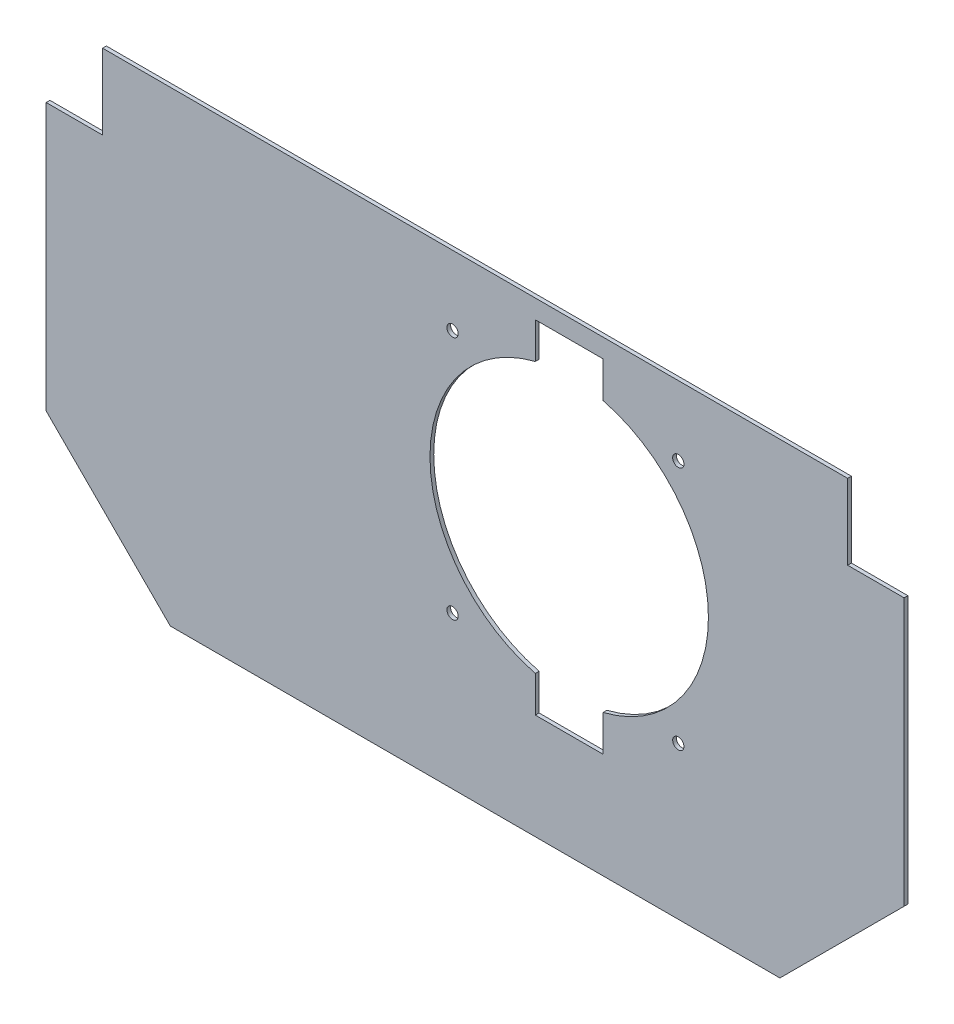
ISO-10303-21;
HEADER;
FILE_DESCRIPTION(('STEP AP214'),'2;1');
FILE_NAME('part.step','',(''),(''),'','','');
FILE_SCHEMA(('AUTOMOTIVE_DESIGN { 1 0 10303 214 1 1 1 1 }'));
ENDSEC;
DATA;
#1=APPLICATION_CONTEXT('core data for automotive mechanical design processes');
#2=APPLICATION_PROTOCOL_DEFINITION('international standard','automotive_design',2000,#1);
#3=PRODUCT_CONTEXT('',#1,'mechanical');
#4=PRODUCT('Part','Part','',(#3));
#5=PRODUCT_RELATED_PRODUCT_CATEGORY('part','',(#4));
#6=PRODUCT_DEFINITION_FORMATION('','',#4);
#7=PRODUCT_DEFINITION_CONTEXT('part definition',#1,'design');
#8=PRODUCT_DEFINITION('design','',#6,#7);
#9=PRODUCT_DEFINITION_SHAPE('','',#8);
#10=(LENGTH_UNIT() NAMED_UNIT(*) SI_UNIT(.MILLI.,.METRE.));
#11=(NAMED_UNIT(*) PLANE_ANGLE_UNIT() SI_UNIT($,.RADIAN.));
#12=(NAMED_UNIT(*) SI_UNIT($,.STERADIAN.) SOLID_ANGLE_UNIT());
#13=UNCERTAINTY_MEASURE_WITH_UNIT(LENGTH_MEASURE(1.E-05),#10,'distance_accuracy_value','');
#14=(GEOMETRIC_REPRESENTATION_CONTEXT(3) GLOBAL_UNCERTAINTY_ASSIGNED_CONTEXT((#13)) GLOBAL_UNIT_ASSIGNED_CONTEXT((#10,
#11,#12)) REPRESENTATION_CONTEXT('',''));
#15=CARTESIAN_POINT('',(0.,0.,0.));
#16=DIRECTION('',(0.,0.,1.));
#17=DIRECTION('',(1.,0.,0.));
#18=AXIS2_PLACEMENT_3D('',#15,#16,#17);
#19=CARTESIAN_POINT('',(0.,0.,1.));
#20=DIRECTION('',(0.,0.,-1.));
#21=DIRECTION('',(-1.,0.,0.));
#22=AXIS2_PLACEMENT_3D('',#19,#20,#21);
#23=PLANE('',#22);
#24=DIRECTION('',(-1.,0.,0.));
#25=VECTOR('',#24,1.);
#26=CARTESIAN_POINT('',(-73.8346823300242,58.4591752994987,1.));
#27=LINE('',#26,#25);
#28=CARTESIAN_POINT('',(124.165317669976,58.4591752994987,1.));
#29=VERTEX_POINT('',#28);
#30=CARTESIAN_POINT('',(-73.8346823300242,58.4591752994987,1.));
#31=VERTEX_POINT('',#30);
#32=EDGE_CURVE('E228',#29,#31,#27,.T.);
#33=ORIENTED_EDGE('',*,*,#32,.T.);
#34=DIRECTION('',(0.,-1.,0.));
#35=VECTOR('',#34,1.);
#36=CARTESIAN_POINT('',(-73.8346823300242,58.4591752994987,1.));
#37=LINE('',#36,#35);
#38=CARTESIAN_POINT('',(-73.8346823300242,38.4591752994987,1.));
#39=VERTEX_POINT('',#38);
#40=EDGE_CURVE('E231',#31,#39,#37,.T.);
#41=ORIENTED_EDGE('',*,*,#40,.T.);
#42=DIRECTION('',(-1.,0.,0.));
#43=VECTOR('',#42,1.);
#44=CARTESIAN_POINT('',(-73.8346823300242,38.4591752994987,1.));
#45=LINE('',#44,#43);
#46=CARTESIAN_POINT('',(-88.8346823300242,38.4591752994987,1.));
#47=VERTEX_POINT('',#46);
#48=EDGE_CURVE('E234',#39,#47,#45,.T.);
#49=ORIENTED_EDGE('',*,*,#48,.T.);
#50=DIRECTION('',(0.,-1.,0.));
#51=VECTOR('',#50,1.);
#52=CARTESIAN_POINT('',(-88.8346823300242,-32.5408247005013,1.));
#53=LINE('',#52,#51);
#54=CARTESIAN_POINT('',(-88.8346823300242,-32.5408247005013,1.));
#55=VERTEX_POINT('',#54);
#56=EDGE_CURVE('E236',#47,#55,#53,.T.);
#57=ORIENTED_EDGE('',*,*,#56,.T.);
#58=DIRECTION('',(0.707106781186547,-0.707106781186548,0.));
#59=VECTOR('',#58,1.);
#60=CARTESIAN_POINT('',(-88.8346823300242,-32.5408247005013,1.));
#61=LINE('',#60,#59);
#62=CARTESIAN_POINT('',(-55.8346823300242,-65.5408247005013,1.));
#63=VERTEX_POINT('',#62);
#64=EDGE_CURVE('E238',#55,#63,#61,.T.);
#65=ORIENTED_EDGE('',*,*,#64,.T.);
#66=DIRECTION('',(1.,0.,0.));
#67=VECTOR('',#66,1.);
#68=CARTESIAN_POINT('',(-55.8346823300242,-65.5408247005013,1.));
#69=LINE('',#68,#67);
#70=CARTESIAN_POINT('',(106.165317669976,-65.5408247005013,1.));
#71=VERTEX_POINT('',#70);
#72=EDGE_CURVE('E240',#63,#71,#69,.T.);
#73=ORIENTED_EDGE('',*,*,#72,.T.);
#74=DIRECTION('',(0.707106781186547,0.707106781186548,0.));
#75=VECTOR('',#74,1.);
#76=CARTESIAN_POINT('',(106.165317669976,-65.5408247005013,1.));
#77=LINE('',#76,#75);
#78=CARTESIAN_POINT('',(139.165317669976,-32.5408247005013,1.));
#79=VERTEX_POINT('',#78);
#80=EDGE_CURVE('E242',#71,#79,#77,.T.);
#81=ORIENTED_EDGE('',*,*,#80,.T.);
#82=DIRECTION('',(0.,1.,0.));
#83=VECTOR('',#82,1.);
#84=CARTESIAN_POINT('',(139.165317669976,-32.5408247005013,1.));
#85=LINE('',#84,#83);
#86=CARTESIAN_POINT('',(139.165317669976,38.4591752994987,1.));
#87=VERTEX_POINT('',#86);
#88=EDGE_CURVE('E244',#79,#87,#85,.T.);
#89=ORIENTED_EDGE('',*,*,#88,.T.);
#90=DIRECTION('',(-1.,0.,0.));
#91=VECTOR('',#90,1.);
#92=CARTESIAN_POINT('',(124.165317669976,38.4591752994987,1.));
#93=LINE('',#92,#91);
#94=CARTESIAN_POINT('',(124.165317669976,38.4591752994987,1.));
#95=VERTEX_POINT('',#94);
#96=EDGE_CURVE('E246',#87,#95,#93,.T.);
#97=ORIENTED_EDGE('',*,*,#96,.T.);
#98=DIRECTION('',(0.,1.,0.));
#99=VECTOR('',#98,1.);
#100=CARTESIAN_POINT('',(124.165317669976,58.4591752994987,1.));
#101=LINE('',#100,#99);
#102=EDGE_CURVE('E248',#95,#29,#101,.T.);
#103=ORIENTED_EDGE('',*,*,#102,.T.);
#104=EDGE_LOOP('',(#33,#41,#49,#57,#65,#73,#81,#89,#97,#103));
#105=FACE_BOUND('',#104,.T.);
#106=DIRECTION('',(0.,-1.,0.));
#107=VECTOR('',#106,1.);
#108=CARTESIAN_POINT('',(41.1653176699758,53.4591752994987,1.));
#109=LINE('',#108,#107);
#110=CARTESIAN_POINT('',(41.1653176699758,53.4591752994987,1.));
#111=VERTEX_POINT('',#110);
#112=CARTESIAN_POINT('',(41.1653176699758,43.8478921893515,1.));
#113=VERTEX_POINT('',#112);
#114=EDGE_CURVE('E160',#111,#113,#109,.T.);
#115=ORIENTED_EDGE('',*,*,#114,.F.);
#116=DIRECTION('',(-1.,0.,0.));
#117=VECTOR('',#116,1.);
#118=CARTESIAN_POINT('',(41.1653176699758,53.4591752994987,1.));
#119=LINE('',#118,#117);
#120=CARTESIAN_POINT('',(59.1653176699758,53.4591752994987,1.));
#121=VERTEX_POINT('',#120);
#122=EDGE_CURVE('E195',#121,#111,#119,.T.);
#123=ORIENTED_EDGE('',*,*,#122,.F.);
#124=DIRECTION('',(0.,1.,0.));
#125=VECTOR('',#124,1.);
#126=CARTESIAN_POINT('',(59.1653176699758,53.4591752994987,1.));
#127=LINE('',#126,#125);
#128=CARTESIAN_POINT('',(59.1653176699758,43.8478921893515,1.));
#129=VERTEX_POINT('',#128);
#130=EDGE_CURVE('E193',#129,#121,#127,.T.);
#131=ORIENTED_EDGE('',*,*,#130,.F.);
#132=CARTESIAN_POINT('',(50.1653176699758,7.95917529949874,1.));
#133=DIRECTION('',(0.,0.,1.));
#134=DIRECTION('',(1.,0.,0.));
#135=AXIS2_PLACEMENT_3D('',#132,#133,#134);
#136=CIRCLE('',#135,37.);
#137=CARTESIAN_POINT('',(59.1653176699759,-27.929541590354,1.));
#138=VERTEX_POINT('',#137);
#139=EDGE_CURVE('E191',#138,#129,#136,.T.);
#140=ORIENTED_EDGE('',*,*,#139,.F.);
#141=DIRECTION('',(0.,1.,0.));
#142=VECTOR('',#141,1.);
#143=CARTESIAN_POINT('',(59.1653176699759,-37.5408247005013,1.));
#144=LINE('',#143,#142);
#145=CARTESIAN_POINT('',(59.1653176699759,-37.5408247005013,1.));
#146=VERTEX_POINT('',#145);
#147=EDGE_CURVE('E189',#146,#138,#144,.T.);
#148=ORIENTED_EDGE('',*,*,#147,.F.);
#149=DIRECTION('',(1.,0.,0.));
#150=VECTOR('',#149,1.);
#151=CARTESIAN_POINT('',(41.1653176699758,-37.5408247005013,1.));
#152=LINE('',#151,#150);
#153=CARTESIAN_POINT('',(41.1653176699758,-37.5408247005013,1.));
#154=VERTEX_POINT('',#153);
#155=EDGE_CURVE('E184',#154,#146,#152,.T.);
#156=ORIENTED_EDGE('',*,*,#155,.F.);
#157=DIRECTION('',(0.,-1.,0.));
#158=VECTOR('',#157,1.);
#159=CARTESIAN_POINT('',(41.1653176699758,-37.5408247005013,1.));
#160=LINE('',#159,#158);
#161=CARTESIAN_POINT('',(41.1653176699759,-27.929541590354,1.));
#162=VERTEX_POINT('',#161);
#163=EDGE_CURVE('E182',#162,#154,#160,.T.);
#164=ORIENTED_EDGE('',*,*,#163,.F.);
#165=CARTESIAN_POINT('',(50.1653176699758,7.95917529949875,1.));
#166=DIRECTION('',(0.,0.,1.));
#167=DIRECTION('',(-1.,0.,0.));
#168=AXIS2_PLACEMENT_3D('',#165,#166,#167);
#169=CIRCLE('',#168,37.);
#170=EDGE_CURVE('E168',#113,#162,#169,.T.);
#171=ORIENTED_EDGE('',*,*,#170,.F.);
#172=EDGE_LOOP('',(#115,#123,#131,#140,#148,#156,#164,#171));
#173=FACE_BOUND('',#172,.T.);
#174=CARTESIAN_POINT('',(79.1653176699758,39.9591752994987,1.));
#175=DIRECTION('',(0.,0.,1.));
#176=DIRECTION('',(1.,0.,0.));
#177=AXIS2_PLACEMENT_3D('',#174,#175,#176);
#178=CIRCLE('',#177,1.5);
#179=CARTESIAN_POINT('',(80.6653176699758,39.9591752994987,1.));
#180=VERTEX_POINT('',#179);
#181=EDGE_CURVE('E198',#180,#180,#178,.T.);
#182=ORIENTED_EDGE('',*,*,#181,.F.);
#183=EDGE_LOOP('',(#182));
#184=FACE_BOUND('',#183,.T.);
#185=CARTESIAN_POINT('',(19.1653176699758,39.9591752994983,1.));
#186=DIRECTION('',(0.,0.,1.));
#187=DIRECTION('',(1.,0.,0.));
#188=AXIS2_PLACEMENT_3D('',#185,#186,#187);
#189=CIRCLE('',#188,1.5);
#190=CARTESIAN_POINT('',(20.6653176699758,39.9591752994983,1.));
#191=VERTEX_POINT('',#190);
#192=EDGE_CURVE('E572',#191,#191,#189,.T.);
#193=ORIENTED_EDGE('',*,*,#192,.F.);
#194=EDGE_LOOP('',(#193));
#195=FACE_BOUND('',#194,.T.);
#196=CARTESIAN_POINT('',(19.1653176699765,-25.0408247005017,1.));
#197=DIRECTION('',(0.,0.,1.));
#198=DIRECTION('',(1.,0.,0.));
#199=AXIS2_PLACEMENT_3D('',#196,#197,#198);
#200=CIRCLE('',#199,1.5);
#201=CARTESIAN_POINT('',(20.6653176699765,-25.0408247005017,1.));
#202=VERTEX_POINT('',#201);
#203=EDGE_CURVE('E566',#202,#202,#200,.T.);
#204=ORIENTED_EDGE('',*,*,#203,.F.);
#205=EDGE_LOOP('',(#204));
#206=FACE_BOUND('',#205,.T.);
#207=CARTESIAN_POINT('',(79.1653176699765,-25.0408247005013,1.));
#208=DIRECTION('',(0.,0.,1.));
#209=DIRECTION('',(1.,0.,0.));
#210=AXIS2_PLACEMENT_3D('',#207,#208,#209);
#211=CIRCLE('',#210,1.5);
#212=CARTESIAN_POINT('',(80.6653176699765,-25.0408247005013,1.));
#213=VERTEX_POINT('',#212);
#214=EDGE_CURVE('E557',#213,#213,#211,.T.);
#215=ORIENTED_EDGE('',*,*,#214,.F.);
#216=EDGE_LOOP('',(#215));
#217=FACE_BOUND('',#216,.T.);
#218=ADVANCED_FACE('F35',(#105,#173,#184,#195,#206,#217),#23,.F.);
#219=CARTESIAN_POINT('',(0.,0.,0.));
#220=DIRECTION('',(0.,0.,-1.));
#221=DIRECTION('',(-1.,0.,0.));
#222=AXIS2_PLACEMENT_3D('',#219,#220,#221);
#223=PLANE('',#222);
#224=CARTESIAN_POINT('',(19.1653176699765,-25.0408247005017,0.));
#225=DIRECTION('',(0.,0.,1.));
#226=DIRECTION('',(1.,0.,0.));
#227=AXIS2_PLACEMENT_3D('',#224,#225,#226);
#228=CIRCLE('',#227,1.5);
#229=CARTESIAN_POINT('',(20.6653176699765,-25.0408247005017,0.));
#230=VERTEX_POINT('',#229);
#231=EDGE_CURVE('E563',#230,#230,#228,.T.);
#232=ORIENTED_EDGE('',*,*,#231,.T.);
#233=EDGE_LOOP('',(#232));
#234=FACE_BOUND('',#233,.T.);
#235=CARTESIAN_POINT('',(79.1653176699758,39.9591752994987,0.));
#236=DIRECTION('',(0.,0.,1.));
#237=DIRECTION('',(1.,0.,0.));
#238=AXIS2_PLACEMENT_3D('',#235,#236,#237);
#239=CIRCLE('',#238,1.5);
#240=CARTESIAN_POINT('',(80.6653176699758,39.9591752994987,0.));
#241=VERTEX_POINT('',#240);
#242=EDGE_CURVE('E575',#241,#241,#239,.T.);
#243=ORIENTED_EDGE('',*,*,#242,.T.);
#244=EDGE_LOOP('',(#243));
#245=FACE_BOUND('',#244,.T.);
#246=DIRECTION('',(-1.,0.,0.));
#247=VECTOR('',#246,1.);
#248=CARTESIAN_POINT('',(-73.8346823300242,58.4591752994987,0.));
#249=LINE('',#248,#247);
#250=CARTESIAN_POINT('',(124.165317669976,58.4591752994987,0.));
#251=VERTEX_POINT('',#250);
#252=CARTESIAN_POINT('',(-73.8346823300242,58.4591752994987,0.));
#253=VERTEX_POINT('',#252);
#254=EDGE_CURVE('E176',#251,#253,#249,.T.);
#255=ORIENTED_EDGE('',*,*,#254,.F.);
#256=DIRECTION('',(0.,1.,0.));
#257=VECTOR('',#256,1.);
#258=CARTESIAN_POINT('',(124.165317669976,58.4591752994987,0.));
#259=LINE('',#258,#257);
#260=CARTESIAN_POINT('',(124.165317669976,38.4591752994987,0.));
#261=VERTEX_POINT('',#260);
#262=EDGE_CURVE('E232',#261,#251,#259,.T.);
#263=ORIENTED_EDGE('',*,*,#262,.F.);
#264=DIRECTION('',(-1.,0.,0.));
#265=VECTOR('',#264,1.);
#266=CARTESIAN_POINT('',(124.165317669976,38.4591752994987,0.));
#267=LINE('',#266,#265);
#268=CARTESIAN_POINT('',(139.165317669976,38.4591752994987,0.));
#269=VERTEX_POINT('',#268);
#270=EDGE_CURVE('E267',#269,#261,#267,.T.);
#271=ORIENTED_EDGE('',*,*,#270,.F.);
#272=DIRECTION('',(0.,1.,0.));
#273=VECTOR('',#272,1.);
#274=CARTESIAN_POINT('',(139.165317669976,-32.5408247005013,0.));
#275=LINE('',#274,#273);
#276=CARTESIAN_POINT('',(139.165317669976,-32.5408247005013,0.));
#277=VERTEX_POINT('',#276);
#278=EDGE_CURVE('E265',#277,#269,#275,.T.);
#279=ORIENTED_EDGE('',*,*,#278,.F.);
#280=DIRECTION('',(0.707106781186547,0.707106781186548,0.));
#281=VECTOR('',#280,1.);
#282=CARTESIAN_POINT('',(106.165317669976,-65.5408247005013,0.));
#283=LINE('',#282,#281);
#284=CARTESIAN_POINT('',(106.165317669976,-65.5408247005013,0.));
#285=VERTEX_POINT('',#284);
#286=EDGE_CURVE('E263',#285,#277,#283,.T.);
#287=ORIENTED_EDGE('',*,*,#286,.F.);
#288=DIRECTION('',(1.,0.,0.));
#289=VECTOR('',#288,1.);
#290=CARTESIAN_POINT('',(-55.8346823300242,-65.5408247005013,0.));
#291=LINE('',#290,#289);
#292=CARTESIAN_POINT('',(-55.8346823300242,-65.5408247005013,0.));
#293=VERTEX_POINT('',#292);
#294=EDGE_CURVE('E261',#293,#285,#291,.T.);
#295=ORIENTED_EDGE('',*,*,#294,.F.);
#296=DIRECTION('',(0.707106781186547,-0.707106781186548,0.));
#297=VECTOR('',#296,1.);
#298=CARTESIAN_POINT('',(-88.8346823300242,-32.5408247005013,0.));
#299=LINE('',#298,#297);
#300=CARTESIAN_POINT('',(-88.8346823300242,-32.5408247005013,0.));
#301=VERTEX_POINT('',#300);
#302=EDGE_CURVE('E259',#301,#293,#299,.T.);
#303=ORIENTED_EDGE('',*,*,#302,.F.);
#304=DIRECTION('',(0.,-1.,0.));
#305=VECTOR('',#304,1.);
#306=CARTESIAN_POINT('',(-88.8346823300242,-32.5408247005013,0.));
#307=LINE('',#306,#305);
#308=CARTESIAN_POINT('',(-88.8346823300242,38.4591752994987,0.));
#309=VERTEX_POINT('',#308);
#310=EDGE_CURVE('E257',#309,#301,#307,.T.);
#311=ORIENTED_EDGE('',*,*,#310,.F.);
#312=DIRECTION('',(-1.,0.,0.));
#313=VECTOR('',#312,1.);
#314=CARTESIAN_POINT('',(-73.8346823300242,38.4591752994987,0.));
#315=LINE('',#314,#313);
#316=CARTESIAN_POINT('',(-73.8346823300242,38.4591752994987,0.));
#317=VERTEX_POINT('',#316);
#318=EDGE_CURVE('E255',#317,#309,#315,.T.);
#319=ORIENTED_EDGE('',*,*,#318,.F.);
#320=DIRECTION('',(0.,-1.,0.));
#321=VECTOR('',#320,1.);
#322=CARTESIAN_POINT('',(-73.8346823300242,58.4591752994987,0.));
#323=LINE('',#322,#321);
#324=EDGE_CURVE('E253',#253,#317,#323,.T.);
#325=ORIENTED_EDGE('',*,*,#324,.F.);
#326=EDGE_LOOP('',(#255,#263,#271,#279,#287,#295,#303,#311,#319,#325));
#327=FACE_BOUND('',#326,.T.);
#328=DIRECTION('',(-1.,0.,0.));
#329=VECTOR('',#328,1.);
#330=CARTESIAN_POINT('',(41.1653176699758,53.4591752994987,0.));
#331=LINE('',#330,#329);
#332=CARTESIAN_POINT('',(59.1653176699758,53.4591752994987,0.));
#333=VERTEX_POINT('',#332);
#334=CARTESIAN_POINT('',(41.1653176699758,53.4591752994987,0.));
#335=VERTEX_POINT('',#334);
#336=EDGE_CURVE('E169',#333,#335,#331,.T.);
#337=ORIENTED_EDGE('',*,*,#336,.T.);
#338=DIRECTION('',(0.,-1.,0.));
#339=VECTOR('',#338,1.);
#340=CARTESIAN_POINT('',(41.1653176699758,53.4591752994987,0.));
#341=LINE('',#340,#339);
#342=CARTESIAN_POINT('',(41.1653176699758,43.8478921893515,0.));
#343=VERTEX_POINT('',#342);
#344=EDGE_CURVE('E58',#335,#343,#341,.T.);
#345=ORIENTED_EDGE('',*,*,#344,.T.);
#346=CARTESIAN_POINT('',(50.1653176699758,7.95917529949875,0.));
#347=DIRECTION('',(0.,0.,1.));
#348=DIRECTION('',(-1.,0.,0.));
#349=AXIS2_PLACEMENT_3D('',#346,#347,#348);
#350=CIRCLE('',#349,37.);
#351=CARTESIAN_POINT('',(41.1653176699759,-27.929541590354,0.));
#352=VERTEX_POINT('',#351);
#353=EDGE_CURVE('E175',#343,#352,#350,.T.);
#354=ORIENTED_EDGE('',*,*,#353,.T.);
#355=DIRECTION('',(0.,-1.,0.));
#356=VECTOR('',#355,1.);
#357=CARTESIAN_POINT('',(41.1653176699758,-37.5408247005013,0.));
#358=LINE('',#357,#356);
#359=CARTESIAN_POINT('',(41.1653176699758,-37.5408247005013,0.));
#360=VERTEX_POINT('',#359);
#361=EDGE_CURVE('E200',#352,#360,#358,.T.);
#362=ORIENTED_EDGE('',*,*,#361,.T.);
#363=DIRECTION('',(1.,0.,0.));
#364=VECTOR('',#363,1.);
#365=CARTESIAN_POINT('',(41.1653176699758,-37.5408247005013,0.));
#366=LINE('',#365,#364);
#367=CARTESIAN_POINT('',(59.1653176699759,-37.5408247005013,0.));
#368=VERTEX_POINT('',#367);
#369=EDGE_CURVE('E203',#360,#368,#366,.T.);
#370=ORIENTED_EDGE('',*,*,#369,.T.);
#371=DIRECTION('',(0.,1.,0.));
#372=VECTOR('',#371,1.);
#373=CARTESIAN_POINT('',(59.1653176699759,-37.5408247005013,0.));
#374=LINE('',#373,#372);
#375=CARTESIAN_POINT('',(59.1653176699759,-27.929541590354,0.));
#376=VERTEX_POINT('',#375);
#377=EDGE_CURVE('E206',#368,#376,#374,.T.);
#378=ORIENTED_EDGE('',*,*,#377,.T.);
#379=CARTESIAN_POINT('',(50.1653176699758,7.95917529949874,0.));
#380=DIRECTION('',(0.,0.,1.));
#381=DIRECTION('',(1.,0.,0.));
#382=AXIS2_PLACEMENT_3D('',#379,#380,#381);
#383=CIRCLE('',#382,37.);
#384=CARTESIAN_POINT('',(59.1653176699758,43.8478921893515,0.));
#385=VERTEX_POINT('',#384);
#386=EDGE_CURVE('E209',#376,#385,#383,.T.);
#387=ORIENTED_EDGE('',*,*,#386,.T.);
#388=DIRECTION('',(0.,1.,0.));
#389=VECTOR('',#388,1.);
#390=CARTESIAN_POINT('',(59.1653176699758,53.4591752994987,0.));
#391=LINE('',#390,#389);
#392=EDGE_CURVE('E212',#385,#333,#391,.T.);
#393=ORIENTED_EDGE('',*,*,#392,.T.);
#394=EDGE_LOOP('',(#337,#345,#354,#362,#370,#378,#387,#393));
#395=FACE_BOUND('',#394,.T.);
#396=CARTESIAN_POINT('',(19.1653176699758,39.9591752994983,0.));
#397=DIRECTION('',(0.,0.,1.));
#398=DIRECTION('',(1.,0.,0.));
#399=AXIS2_PLACEMENT_3D('',#396,#397,#398);
#400=CIRCLE('',#399,1.5);
#401=CARTESIAN_POINT('',(20.6653176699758,39.9591752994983,0.));
#402=VERTEX_POINT('',#401);
#403=EDGE_CURVE('E569',#402,#402,#400,.T.);
#404=ORIENTED_EDGE('',*,*,#403,.T.);
#405=EDGE_LOOP('',(#404));
#406=FACE_BOUND('',#405,.T.);
#407=CARTESIAN_POINT('',(79.1653176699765,-25.0408247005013,0.));
#408=DIRECTION('',(0.,0.,1.));
#409=DIRECTION('',(1.,0.,0.));
#410=AXIS2_PLACEMENT_3D('',#407,#408,#409);
#411=CIRCLE('',#410,1.5);
#412=CARTESIAN_POINT('',(80.6653176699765,-25.0408247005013,0.));
#413=VERTEX_POINT('',#412);
#414=EDGE_CURVE('E560',#413,#413,#411,.T.);
#415=ORIENTED_EDGE('',*,*,#414,.T.);
#416=EDGE_LOOP('',(#415));
#417=FACE_BOUND('',#416,.T.);
#418=ADVANCED_FACE('F303',(#234,#245,#327,#395,#406,#417),#223,.T.);
#419=CARTESIAN_POINT('',(-73.8346823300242,58.4591752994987,1.));
#420=DIRECTION('',(0.,-1.,0.));
#421=DIRECTION('',(0.,0.,-1.));
#422=AXIS2_PLACEMENT_3D('',#419,#420,#421);
#423=PLANE('',#422);
#424=ORIENTED_EDGE('',*,*,#254,.T.);
#425=DIRECTION('',(0.,0.,-1.));
#426=VECTOR('',#425,1.);
#427=CARTESIAN_POINT('',(-73.8346823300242,58.4591752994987,1.));
#428=LINE('',#427,#426);
#429=EDGE_CURVE('E11',#31,#253,#428,.T.);
#430=ORIENTED_EDGE('',*,*,#429,.F.);
#431=ORIENTED_EDGE('',*,*,#32,.F.);
#432=DIRECTION('',(0.,0.,-1.));
#433=VECTOR('',#432,1.);
#434=CARTESIAN_POINT('',(124.165317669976,58.4591752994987,1.));
#435=LINE('',#434,#433);
#436=EDGE_CURVE('E250',#29,#251,#435,.T.);
#437=ORIENTED_EDGE('',*,*,#436,.T.);
#438=EDGE_LOOP('',(#424,#430,#431,#437));
#439=FACE_BOUND('',#438,.T.);
#440=ADVANCED_FACE('F37',(#439),#423,.F.);
#441=CARTESIAN_POINT('',(-73.8346823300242,58.4591752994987,1.));
#442=DIRECTION('',(1.,0.,0.));
#443=DIRECTION('',(0.,1.,0.));
#444=AXIS2_PLACEMENT_3D('',#441,#442,#443);
#445=PLANE('',#444);
#446=ORIENTED_EDGE('',*,*,#324,.T.);
#447=DIRECTION('',(0.,0.,-1.));
#448=VECTOR('',#447,1.);
#449=CARTESIAN_POINT('',(-73.8346823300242,38.4591752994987,1.));
#450=LINE('',#449,#448);
#451=EDGE_CURVE('E43',#39,#317,#450,.T.);
#452=ORIENTED_EDGE('',*,*,#451,.F.);
#453=ORIENTED_EDGE('',*,*,#40,.F.);
#454=ORIENTED_EDGE('',*,*,#429,.T.);
#455=EDGE_LOOP('',(#446,#452,#453,#454));
#456=FACE_BOUND('',#455,.T.);
#457=ADVANCED_FACE('F320',(#456),#445,.F.);
#458=CARTESIAN_POINT('',(-73.8346823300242,38.4591752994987,1.));
#459=DIRECTION('',(0.,-1.,0.));
#460=DIRECTION('',(1.,0.,0.));
#461=AXIS2_PLACEMENT_3D('',#458,#459,#460);
#462=PLANE('',#461);
#463=ORIENTED_EDGE('',*,*,#318,.T.);
#464=DIRECTION('',(0.,0.,-1.));
#465=VECTOR('',#464,1.);
#466=CARTESIAN_POINT('',(-88.8346823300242,38.4591752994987,1.));
#467=LINE('',#466,#465);
#468=EDGE_CURVE('E290',#47,#309,#467,.T.);
#469=ORIENTED_EDGE('',*,*,#468,.F.);
#470=ORIENTED_EDGE('',*,*,#48,.F.);
#471=ORIENTED_EDGE('',*,*,#451,.T.);
#472=EDGE_LOOP('',(#463,#469,#470,#471));
#473=FACE_BOUND('',#472,.T.);
#474=ADVANCED_FACE('F297',(#473),#462,.F.);
#475=CARTESIAN_POINT('',(-88.8346823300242,-32.5408247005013,1.));
#476=DIRECTION('',(1.,0.,0.));
#477=DIRECTION('',(0.,0.,-1.));
#478=AXIS2_PLACEMENT_3D('',#475,#476,#477);
#479=PLANE('',#478);
#480=ORIENTED_EDGE('',*,*,#310,.T.);
#481=DIRECTION('',(0.,0.,-1.));
#482=VECTOR('',#481,1.);
#483=CARTESIAN_POINT('',(-88.8346823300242,-32.5408247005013,1.));
#484=LINE('',#483,#482);
#485=EDGE_CURVE('E287',#55,#301,#484,.T.);
#486=ORIENTED_EDGE('',*,*,#485,.F.);
#487=ORIENTED_EDGE('',*,*,#56,.F.);
#488=ORIENTED_EDGE('',*,*,#468,.T.);
#489=EDGE_LOOP('',(#480,#486,#487,#488));
#490=FACE_BOUND('',#489,.T.);
#491=ADVANCED_FACE('F309',(#490),#479,.F.);
#492=CARTESIAN_POINT('',(-88.8346823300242,-32.5408247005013,1.));
#493=DIRECTION('',(0.707106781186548,0.707106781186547,0.));
#494=DIRECTION('',(-0.707106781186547,0.707106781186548,0.));
#495=AXIS2_PLACEMENT_3D('',#492,#493,#494);
#496=PLANE('',#495);
#497=ORIENTED_EDGE('',*,*,#302,.T.);
#498=DIRECTION('',(0.,0.,-1.));
#499=VECTOR('',#498,1.);
#500=CARTESIAN_POINT('',(-55.8346823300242,-65.5408247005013,1.));
#501=LINE('',#500,#499);
#502=EDGE_CURVE('E284',#63,#293,#501,.T.);
#503=ORIENTED_EDGE('',*,*,#502,.F.);
#504=ORIENTED_EDGE('',*,*,#64,.F.);
#505=ORIENTED_EDGE('',*,*,#485,.T.);
#506=EDGE_LOOP('',(#497,#503,#504,#505));
#507=FACE_BOUND('',#506,.T.);
#508=ADVANCED_FACE('F313',(#507),#496,.F.);
#509=CARTESIAN_POINT('',(-55.8346823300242,-65.5408247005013,1.));
#510=DIRECTION('',(0.,1.,0.));
#511=DIRECTION('',(0.,0.,1.));
#512=AXIS2_PLACEMENT_3D('',#509,#510,#511);
#513=PLANE('',#512);
#514=ORIENTED_EDGE('',*,*,#294,.T.);
#515=DIRECTION('',(0.,0.,-1.));
#516=VECTOR('',#515,1.);
#517=CARTESIAN_POINT('',(106.165317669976,-65.5408247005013,1.));
#518=LINE('',#517,#516);
#519=EDGE_CURVE('E281',#71,#285,#518,.T.);
#520=ORIENTED_EDGE('',*,*,#519,.F.);
#521=ORIENTED_EDGE('',*,*,#72,.F.);
#522=ORIENTED_EDGE('',*,*,#502,.T.);
#523=EDGE_LOOP('',(#514,#520,#521,#522));
#524=FACE_BOUND('',#523,.T.);
#525=ADVANCED_FACE('F343',(#524),#513,.F.);
#526=CARTESIAN_POINT('',(106.165317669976,-65.5408247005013,1.));
#527=DIRECTION('',(-0.707106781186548,0.707106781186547,0.));
#528=DIRECTION('',(-0.707106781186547,-0.707106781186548,0.));
#529=AXIS2_PLACEMENT_3D('',#526,#527,#528);
#530=PLANE('',#529);
#531=ORIENTED_EDGE('',*,*,#286,.T.);
#532=DIRECTION('',(0.,0.,-1.));
#533=VECTOR('',#532,1.);
#534=CARTESIAN_POINT('',(139.165317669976,-32.5408247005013,1.));
#535=LINE('',#534,#533);
#536=EDGE_CURVE('E278',#79,#277,#535,.T.);
#537=ORIENTED_EDGE('',*,*,#536,.F.);
#538=ORIENTED_EDGE('',*,*,#80,.F.);
#539=ORIENTED_EDGE('',*,*,#519,.T.);
#540=EDGE_LOOP('',(#531,#537,#538,#539));
#541=FACE_BOUND('',#540,.T.);
#542=ADVANCED_FACE('F340',(#541),#530,.F.);
#543=CARTESIAN_POINT('',(139.165317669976,-32.5408247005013,1.));
#544=DIRECTION('',(-1.,0.,0.));
#545=DIRECTION('',(0.,0.,1.));
#546=AXIS2_PLACEMENT_3D('',#543,#544,#545);
#547=PLANE('',#546);
#548=ORIENTED_EDGE('',*,*,#278,.T.);
#549=DIRECTION('',(0.,0.,-1.));
#550=VECTOR('',#549,1.);
#551=CARTESIAN_POINT('',(139.165317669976,38.4591752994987,1.));
#552=LINE('',#551,#550);
#553=EDGE_CURVE('E275',#87,#269,#552,.T.);
#554=ORIENTED_EDGE('',*,*,#553,.F.);
#555=ORIENTED_EDGE('',*,*,#88,.F.);
#556=ORIENTED_EDGE('',*,*,#536,.T.);
#557=EDGE_LOOP('',(#548,#554,#555,#556));
#558=FACE_BOUND('',#557,.T.);
#559=ADVANCED_FACE('F336',(#558),#547,.F.);
#560=CARTESIAN_POINT('',(124.165317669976,38.4591752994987,1.));
#561=DIRECTION('',(0.,-1.,0.));
#562=DIRECTION('',(0.,0.,-1.));
#563=AXIS2_PLACEMENT_3D('',#560,#561,#562);
#564=PLANE('',#563);
#565=ORIENTED_EDGE('',*,*,#270,.T.);
#566=DIRECTION('',(0.,0.,-1.));
#567=VECTOR('',#566,1.);
#568=CARTESIAN_POINT('',(124.165317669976,38.4591752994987,1.));
#569=LINE('',#568,#567);
#570=EDGE_CURVE('E272',#95,#261,#569,.T.);
#571=ORIENTED_EDGE('',*,*,#570,.F.);
#572=ORIENTED_EDGE('',*,*,#96,.F.);
#573=ORIENTED_EDGE('',*,*,#553,.T.);
#574=EDGE_LOOP('',(#565,#571,#572,#573));
#575=FACE_BOUND('',#574,.T.);
#576=ADVANCED_FACE('F332',(#575),#564,.F.);
#577=CARTESIAN_POINT('',(124.165317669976,58.4591752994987,1.));
#578=DIRECTION('',(-1.,0.,0.));
#579=DIRECTION('',(0.,-1.,0.));
#580=AXIS2_PLACEMENT_3D('',#577,#578,#579);
#581=PLANE('',#580);
#582=ORIENTED_EDGE('',*,*,#262,.T.);
#583=ORIENTED_EDGE('',*,*,#436,.F.);
#584=ORIENTED_EDGE('',*,*,#102,.F.);
#585=ORIENTED_EDGE('',*,*,#570,.T.);
#586=EDGE_LOOP('',(#582,#583,#584,#585));
#587=FACE_BOUND('',#586,.T.);
#588=ADVANCED_FACE('F327',(#587),#581,.F.);
#589=CARTESIAN_POINT('',(41.1653176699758,53.4591752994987,1.));
#590=DIRECTION('',(1.,0.,0.));
#591=DIRECTION('',(0.,1.,0.));
#592=AXIS2_PLACEMENT_3D('',#589,#590,#591);
#593=PLANE('',#592);
#594=ORIENTED_EDGE('',*,*,#344,.F.);
#595=DIRECTION('',(0.,0.,-1.));
#596=VECTOR('',#595,1.);
#597=CARTESIAN_POINT('',(41.1653176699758,53.4591752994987,1.));
#598=LINE('',#597,#596);
#599=EDGE_CURVE('E164',#111,#335,#598,.T.);
#600=ORIENTED_EDGE('',*,*,#599,.F.);
#601=ORIENTED_EDGE('',*,*,#114,.T.);
#602=DIRECTION('',(0.,0.,-1.));
#603=VECTOR('',#602,1.);
#604=CARTESIAN_POINT('',(41.1653176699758,43.8478921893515,1.));
#605=LINE('',#604,#603);
#606=EDGE_CURVE('E163',#113,#343,#605,.T.);
#607=ORIENTED_EDGE('',*,*,#606,.T.);
#608=EDGE_LOOP('',(#594,#600,#601,#607));
#609=FACE_BOUND('',#608,.T.);
#610=ADVANCED_FACE('F162',(#609),#593,.T.);
#611=CARTESIAN_POINT('',(50.1653176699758,7.95917529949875,1.));
#612=DIRECTION('',(0.,0.,-1.));
#613=DIRECTION('',(-1.,0.,0.));
#614=AXIS2_PLACEMENT_3D('',#611,#612,#613);
#615=CYLINDRICAL_SURFACE('',#614,37.);
#616=ORIENTED_EDGE('',*,*,#353,.F.);
#617=ORIENTED_EDGE('',*,*,#606,.F.);
#618=ORIENTED_EDGE('',*,*,#170,.T.);
#619=DIRECTION('',(0.,0.,-1.));
#620=VECTOR('',#619,1.);
#621=CARTESIAN_POINT('',(41.1653176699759,-27.929541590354,1.));
#622=LINE('',#621,#620);
#623=EDGE_CURVE('E177',#162,#352,#622,.T.);
#624=ORIENTED_EDGE('',*,*,#623,.T.);
#625=EDGE_LOOP('',(#616,#617,#618,#624));
#626=FACE_BOUND('',#625,.T.);
#627=ADVANCED_FACE('F172',(#626),#615,.F.);
#628=CARTESIAN_POINT('',(41.1653176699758,-37.5408247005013,1.));
#629=DIRECTION('',(1.,0.,0.));
#630=DIRECTION('',(0.,1.,0.));
#631=AXIS2_PLACEMENT_3D('',#628,#629,#630);
#632=PLANE('',#631);
#633=ORIENTED_EDGE('',*,*,#361,.F.);
#634=ORIENTED_EDGE('',*,*,#623,.F.);
#635=ORIENTED_EDGE('',*,*,#163,.T.);
#636=DIRECTION('',(0.,0.,-1.));
#637=VECTOR('',#636,1.);
#638=CARTESIAN_POINT('',(41.1653176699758,-37.5408247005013,1.));
#639=LINE('',#638,#637);
#640=EDGE_CURVE('E225',#154,#360,#639,.T.);
#641=ORIENTED_EDGE('',*,*,#640,.T.);
#642=EDGE_LOOP('',(#633,#634,#635,#641));
#643=FACE_BOUND('',#642,.T.);
#644=ADVANCED_FACE('F390',(#643),#632,.T.);
#645=CARTESIAN_POINT('',(41.1653176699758,-37.5408247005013,1.));
#646=DIRECTION('',(0.,1.,0.));
#647=DIRECTION('',(0.,0.,1.));
#648=AXIS2_PLACEMENT_3D('',#645,#646,#647);
#649=PLANE('',#648);
#650=ORIENTED_EDGE('',*,*,#369,.F.);
#651=ORIENTED_EDGE('',*,*,#640,.F.);
#652=ORIENTED_EDGE('',*,*,#155,.T.);
#653=DIRECTION('',(0.,0.,-1.));
#654=VECTOR('',#653,1.);
#655=CARTESIAN_POINT('',(59.1653176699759,-37.5408247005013,1.));
#656=LINE('',#655,#654);
#657=EDGE_CURVE('E223',#146,#368,#656,.T.);
#658=ORIENTED_EDGE('',*,*,#657,.T.);
#659=EDGE_LOOP('',(#650,#651,#652,#658));
#660=FACE_BOUND('',#659,.T.);
#661=ADVANCED_FACE('F396',(#660),#649,.T.);
#662=CARTESIAN_POINT('',(59.1653176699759,-37.5408247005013,1.));
#663=DIRECTION('',(-1.,0.,0.));
#664=DIRECTION('',(0.,0.,1.));
#665=AXIS2_PLACEMENT_3D('',#662,#663,#664);
#666=PLANE('',#665);
#667=ORIENTED_EDGE('',*,*,#377,.F.);
#668=ORIENTED_EDGE('',*,*,#657,.F.);
#669=ORIENTED_EDGE('',*,*,#147,.T.);
#670=DIRECTION('',(0.,0.,-1.));
#671=VECTOR('',#670,1.);
#672=CARTESIAN_POINT('',(59.1653176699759,-27.929541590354,1.));
#673=LINE('',#672,#671);
#674=EDGE_CURVE('E221',#138,#376,#673,.T.);
#675=ORIENTED_EDGE('',*,*,#674,.T.);
#676=EDGE_LOOP('',(#667,#668,#669,#675));
#677=FACE_BOUND('',#676,.T.);
#678=ADVANCED_FACE('F404',(#677),#666,.T.);
#679=CARTESIAN_POINT('',(50.1653176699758,7.95917529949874,1.));
#680=DIRECTION('',(0.,0.,-1.));
#681=DIRECTION('',(-1.,0.,0.));
#682=AXIS2_PLACEMENT_3D('',#679,#680,#681);
#683=CYLINDRICAL_SURFACE('',#682,37.);
#684=ORIENTED_EDGE('',*,*,#386,.F.);
#685=ORIENTED_EDGE('',*,*,#674,.F.);
#686=ORIENTED_EDGE('',*,*,#139,.T.);
#687=DIRECTION('',(0.,0.,-1.));
#688=VECTOR('',#687,1.);
#689=CARTESIAN_POINT('',(59.1653176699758,43.8478921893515,1.));
#690=LINE('',#689,#688);
#691=EDGE_CURVE('E219',#129,#385,#690,.T.);
#692=ORIENTED_EDGE('',*,*,#691,.T.);
#693=EDGE_LOOP('',(#684,#685,#686,#692));
#694=FACE_BOUND('',#693,.T.);
#695=ADVANCED_FACE('F412',(#694),#683,.F.);
#696=CARTESIAN_POINT('',(59.1653176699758,53.4591752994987,1.));
#697=DIRECTION('',(-1.,0.,0.));
#698=DIRECTION('',(0.,0.,1.));
#699=AXIS2_PLACEMENT_3D('',#696,#697,#698);
#700=PLANE('',#699);
#701=ORIENTED_EDGE('',*,*,#392,.F.);
#702=ORIENTED_EDGE('',*,*,#691,.F.);
#703=ORIENTED_EDGE('',*,*,#130,.T.);
#704=DIRECTION('',(0.,0.,-1.));
#705=VECTOR('',#704,1.);
#706=CARTESIAN_POINT('',(59.1653176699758,53.4591752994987,1.));
#707=LINE('',#706,#705);
#708=EDGE_CURVE('E50',#121,#333,#707,.T.);
#709=ORIENTED_EDGE('',*,*,#708,.T.);
#710=EDGE_LOOP('',(#701,#702,#703,#709));
#711=FACE_BOUND('',#710,.T.);
#712=ADVANCED_FACE('F420',(#711),#700,.T.);
#713=CARTESIAN_POINT('',(41.1653176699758,53.4591752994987,1.));
#714=DIRECTION('',(0.,-1.,0.));
#715=DIRECTION('',(0.,0.,-1.));
#716=AXIS2_PLACEMENT_3D('',#713,#714,#715);
#717=PLANE('',#716);
#718=ORIENTED_EDGE('',*,*,#336,.F.);
#719=ORIENTED_EDGE('',*,*,#708,.F.);
#720=ORIENTED_EDGE('',*,*,#122,.T.);
#721=ORIENTED_EDGE('',*,*,#599,.T.);
#722=EDGE_LOOP('',(#718,#719,#720,#721));
#723=FACE_BOUND('',#722,.T.);
#724=ADVANCED_FACE('F428',(#723),#717,.T.);
#725=CARTESIAN_POINT('',(79.1653176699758,39.9591752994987,1.));
#726=DIRECTION('',(0.,0.,-1.));
#727=DIRECTION('',(-1.,0.,0.));
#728=AXIS2_PLACEMENT_3D('',#725,#726,#727);
#729=CYLINDRICAL_SURFACE('',#728,1.5);
#730=ORIENTED_EDGE('',*,*,#181,.T.);
#731=EDGE_LOOP('',(#730));
#732=FACE_BOUND('',#731,.T.);
#733=ORIENTED_EDGE('',*,*,#242,.F.);
#734=EDGE_LOOP('',(#733));
#735=FACE_BOUND('',#734,.T.);
#736=ADVANCED_FACE('F436',(#732,#735),#729,.F.);
#737=CARTESIAN_POINT('',(19.1653176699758,39.9591752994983,1.));
#738=DIRECTION('',(0.,0.,-1.));
#739=DIRECTION('',(-1.,0.,0.));
#740=AXIS2_PLACEMENT_3D('',#737,#738,#739);
#741=CYLINDRICAL_SURFACE('',#740,1.5);
#742=ORIENTED_EDGE('',*,*,#192,.T.);
#743=EDGE_LOOP('',(#742));
#744=FACE_BOUND('',#743,.T.);
#745=ORIENTED_EDGE('',*,*,#403,.F.);
#746=EDGE_LOOP('',(#745));
#747=FACE_BOUND('',#746,.T.);
#748=ADVANCED_FACE('F443',(#744,#747),#741,.F.);
#749=CARTESIAN_POINT('',(19.1653176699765,-25.0408247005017,1.));
#750=DIRECTION('',(0.,0.,-1.));
#751=DIRECTION('',(-1.,0.,0.));
#752=AXIS2_PLACEMENT_3D('',#749,#750,#751);
#753=CYLINDRICAL_SURFACE('',#752,1.5);
#754=ORIENTED_EDGE('',*,*,#203,.T.);
#755=EDGE_LOOP('',(#754));
#756=FACE_BOUND('',#755,.T.);
#757=ORIENTED_EDGE('',*,*,#231,.F.);
#758=EDGE_LOOP('',(#757));
#759=FACE_BOUND('',#758,.T.);
#760=ADVANCED_FACE('F451',(#756,#759),#753,.F.);
#761=CARTESIAN_POINT('',(79.1653176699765,-25.0408247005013,1.));
#762=DIRECTION('',(0.,0.,-1.));
#763=DIRECTION('',(-1.,0.,0.));
#764=AXIS2_PLACEMENT_3D('',#761,#762,#763);
#765=CYLINDRICAL_SURFACE('',#764,1.5);
#766=ORIENTED_EDGE('',*,*,#214,.T.);
#767=EDGE_LOOP('',(#766));
#768=FACE_BOUND('',#767,.T.);
#769=ORIENTED_EDGE('',*,*,#414,.F.);
#770=EDGE_LOOP('',(#769));
#771=FACE_BOUND('',#770,.T.);
#772=ADVANCED_FACE('F459',(#768,#771),#765,.F.);
#773=CLOSED_SHELL('',(#218,#418,#440,#457,#474,#491,#508,#525,#542,#559,#576,#588,#610,#627,
#644,#661,#678,#695,#712,#724,#736,#748,#760,#772));
#774=MANIFOLD_SOLID_BREP('B2',#773);
#775=ADVANCED_BREP_SHAPE_REPRESENTATION('',(#18,#774),#14);
#776=SHAPE_DEFINITION_REPRESENTATION(#9,#775);
ENDSEC;
END-ISO-10303-21;
